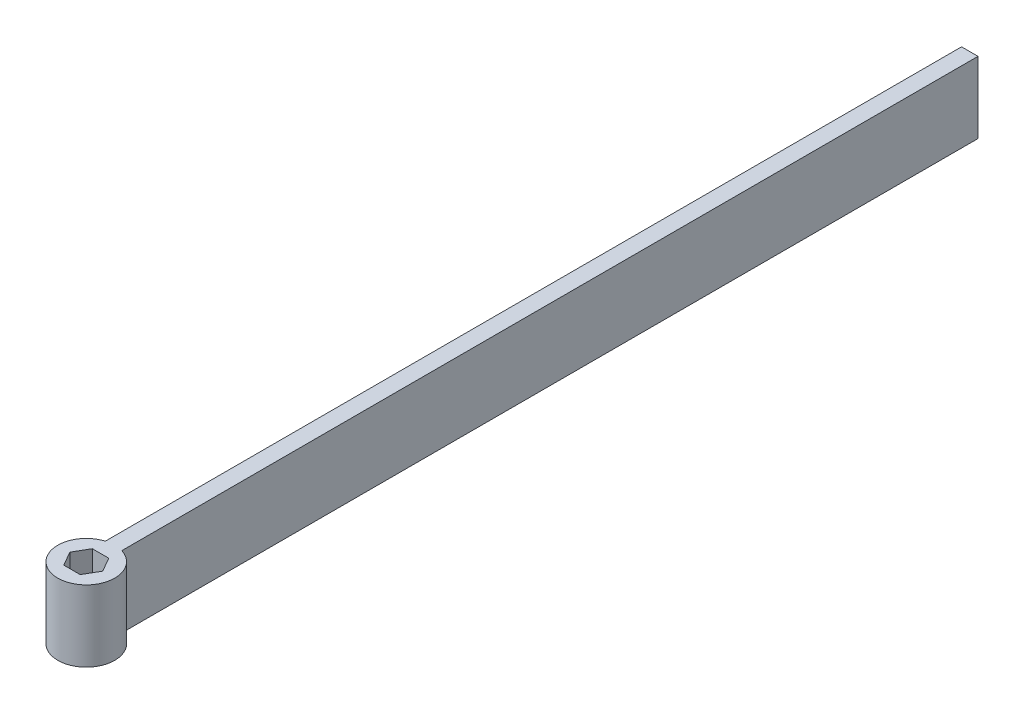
ISO-10303-21;
HEADER;
FILE_DESCRIPTION(('STEP AP214'),'2;1');
FILE_NAME('part.step','',(''),(''),'','','');
FILE_SCHEMA(('AUTOMOTIVE_DESIGN { 1 0 10303 214 1 1 1 1 }'));
ENDSEC;
DATA;
#1=APPLICATION_CONTEXT('core data for automotive mechanical design processes');
#2=APPLICATION_PROTOCOL_DEFINITION('international standard','automotive_design',2000,#1);
#3=PRODUCT_CONTEXT('',#1,'mechanical');
#4=PRODUCT('Part','Part','',(#3));
#5=PRODUCT_RELATED_PRODUCT_CATEGORY('part','',(#4));
#6=PRODUCT_DEFINITION_FORMATION('','',#4);
#7=PRODUCT_DEFINITION_CONTEXT('part definition',#1,'design');
#8=PRODUCT_DEFINITION('design','',#6,#7);
#9=PRODUCT_DEFINITION_SHAPE('','',#8);
#10=(LENGTH_UNIT() NAMED_UNIT(*) SI_UNIT(.MILLI.,.METRE.));
#11=(NAMED_UNIT(*) PLANE_ANGLE_UNIT() SI_UNIT($,.RADIAN.));
#12=(NAMED_UNIT(*) SI_UNIT($,.STERADIAN.) SOLID_ANGLE_UNIT());
#13=UNCERTAINTY_MEASURE_WITH_UNIT(LENGTH_MEASURE(1.E-05),#10,'distance_accuracy_value','');
#14=(GEOMETRIC_REPRESENTATION_CONTEXT(3) GLOBAL_UNCERTAINTY_ASSIGNED_CONTEXT((#13)) GLOBAL_UNIT_ASSIGNED_CONTEXT((#10,
#11,#12)) REPRESENTATION_CONTEXT('',''));
#15=CARTESIAN_POINT('',(0.,0.,0.));
#16=DIRECTION('',(0.,0.,1.));
#17=DIRECTION('',(1.,0.,0.));
#18=AXIS2_PLACEMENT_3D('',#15,#16,#17);
#19=CARTESIAN_POINT('',(0.,0.,-20.));
#20=DIRECTION('',(0.,0.,1.));
#21=DIRECTION('',(1.,0.,0.));
#22=AXIS2_PLACEMENT_3D('',#19,#20,#21);
#23=PLANE('',#22);
#24=DIRECTION('',(0.,-1.,0.));
#25=VECTOR('',#24,1.);
#26=CARTESIAN_POINT('',(-2.,45.,-20.));
#27=LINE('',#26,#25);
#28=CARTESIAN_POINT('',(-2.,45.,-20.));
#29=VERTEX_POINT('',#28);
#30=CARTESIAN_POINT('',(-2.,0.,-20.));
#31=VERTEX_POINT('',#30);
#32=EDGE_CURVE('E57',#29,#31,#27,.T.);
#33=ORIENTED_EDGE('',*,*,#32,.F.);
#34=DIRECTION('',(-1.,0.,0.));
#35=VECTOR('',#34,1.);
#36=CARTESIAN_POINT('',(2.,45.,-20.));
#37=LINE('',#36,#35);
#38=CARTESIAN_POINT('',(2.,45.,-20.));
#39=VERTEX_POINT('',#38);
#40=EDGE_CURVE('E179',#39,#29,#37,.T.);
#41=ORIENTED_EDGE('',*,*,#40,.F.);
#42=DIRECTION('',(0.,1.,0.));
#43=VECTOR('',#42,1.);
#44=CARTESIAN_POINT('',(2.,0.,-20.));
#45=LINE('',#44,#43);
#46=CARTESIAN_POINT('',(2.,0.,-20.));
#47=VERTEX_POINT('',#46);
#48=EDGE_CURVE('E62',#47,#39,#45,.T.);
#49=ORIENTED_EDGE('',*,*,#48,.F.);
#50=DIRECTION('',(1.,0.,0.));
#51=VECTOR('',#50,1.);
#52=CARTESIAN_POINT('',(-5.77350269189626,0.,-20.));
#53=LINE('',#52,#51);
#54=EDGE_CURVE('E166',#31,#47,#53,.T.);
#55=ORIENTED_EDGE('',*,*,#54,.F.);
#56=EDGE_LOOP('',(#33,#41,#49,#55));
#57=FACE_BOUND('',#56,.T.);
#58=ADVANCED_FACE('F40',(#57),#23,.F.);
#59=CARTESIAN_POINT('',(0.,50.,0.));
#60=DIRECTION('',(0.,1.,0.));
#61=DIRECTION('',(0.,0.,1.));
#62=AXIS2_PLACEMENT_3D('',#59,#60,#61);
#63=PLANE('',#62);
#64=DIRECTION('',(-0.5,0.,0.866025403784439));
#65=VECTOR('',#64,1.);
#66=CARTESIAN_POINT('',(-5.77350269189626,50.,-10.));
#67=LINE('',#66,#65);
#68=CARTESIAN_POINT('',(-5.77350269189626,50.,-10.));
#69=VERTEX_POINT('',#68);
#70=CARTESIAN_POINT('',(-11.5470053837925,50.,0.));
#71=VERTEX_POINT('',#70);
#72=EDGE_CURVE('E242',#69,#71,#67,.T.);
#73=ORIENTED_EDGE('',*,*,#72,.F.);
#74=DIRECTION('',(-1.,0.,0.));
#75=VECTOR('',#74,1.);
#76=CARTESIAN_POINT('',(5.77350269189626,50.,-10.));
#77=LINE('',#76,#75);
#78=CARTESIAN_POINT('',(5.77350269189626,50.,-10.));
#79=VERTEX_POINT('',#78);
#80=EDGE_CURVE('E240',#79,#69,#77,.T.);
#81=ORIENTED_EDGE('',*,*,#80,.F.);
#82=DIRECTION('',(-0.5,0.,-0.866025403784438));
#83=VECTOR('',#82,1.);
#84=CARTESIAN_POINT('',(11.5470053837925,50.,0.));
#85=LINE('',#84,#83);
#86=CARTESIAN_POINT('',(11.5470053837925,50.,0.));
#87=VERTEX_POINT('',#86);
#88=EDGE_CURVE('E237',#87,#79,#85,.T.);
#89=ORIENTED_EDGE('',*,*,#88,.F.);
#90=DIRECTION('',(0.5,0.,-0.866025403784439));
#91=VECTOR('',#90,1.);
#92=CARTESIAN_POINT('',(5.77350269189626,50.,10.));
#93=LINE('',#92,#91);
#94=CARTESIAN_POINT('',(5.77350269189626,50.,10.));
#95=VERTEX_POINT('',#94);
#96=EDGE_CURVE('E235',#95,#87,#93,.T.);
#97=ORIENTED_EDGE('',*,*,#96,.F.);
#98=DIRECTION('',(1.,0.,0.));
#99=VECTOR('',#98,1.);
#100=CARTESIAN_POINT('',(-5.77350269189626,50.,10.));
#101=LINE('',#100,#99);
#102=CARTESIAN_POINT('',(-5.77350269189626,50.,10.));
#103=VERTEX_POINT('',#102);
#104=EDGE_CURVE('E247',#103,#95,#101,.T.);
#105=ORIENTED_EDGE('',*,*,#104,.F.);
#106=DIRECTION('',(0.5,0.,0.866025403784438));
#107=VECTOR('',#106,1.);
#108=CARTESIAN_POINT('',(-11.5470053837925,50.,0.));
#109=LINE('',#108,#107);
#110=EDGE_CURVE('E244',#71,#103,#109,.T.);
#111=ORIENTED_EDGE('',*,*,#110,.F.);
#112=EDGE_LOOP('',(#73,#81,#89,#97,#105,#111));
#113=FACE_BOUND('',#112,.T.);
#114=DIRECTION('',(0.,0.,1.));
#115=VECTOR('',#114,1.);
#116=CARTESIAN_POINT('',(-5.77350269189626,50.,-20.));
#117=LINE('',#116,#115);
#118=CARTESIAN_POINT('',(-5.77350269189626,50.,-620.));
#119=VERTEX_POINT('',#118);
#120=CARTESIAN_POINT('',(-5.77350269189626,50.,-19.1485421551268));
#121=VERTEX_POINT('',#120);
#122=EDGE_CURVE('E189',#119,#121,#117,.T.);
#123=ORIENTED_EDGE('',*,*,#122,.T.);
#124=CARTESIAN_POINT('',(0.,50.,0.));
#125=DIRECTION('',(0.,1.,0.));
#126=DIRECTION('',(0.,0.,1.));
#127=AXIS2_PLACEMENT_3D('',#124,#125,#126);
#128=CIRCLE('',#127,20.);
#129=CARTESIAN_POINT('',(5.77350269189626,50.,-19.1485421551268));
#130=VERTEX_POINT('',#129);
#131=EDGE_CURVE('E11',#121,#130,#128,.T.);
#132=ORIENTED_EDGE('',*,*,#131,.T.);
#133=DIRECTION('',(0.,0.,1.));
#134=VECTOR('',#133,1.);
#135=CARTESIAN_POINT('',(5.77350269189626,50.,-20.));
#136=LINE('',#135,#134);
#137=CARTESIAN_POINT('',(5.77350269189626,50.,-620.));
#138=VERTEX_POINT('',#137);
#139=EDGE_CURVE('E223',#138,#130,#136,.T.);
#140=ORIENTED_EDGE('',*,*,#139,.F.);
#141=DIRECTION('',(1.,0.,0.));
#142=VECTOR('',#141,1.);
#143=CARTESIAN_POINT('',(-5.77350269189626,50.,-620.));
#144=LINE('',#143,#142);
#145=EDGE_CURVE('E211',#119,#138,#144,.T.);
#146=ORIENTED_EDGE('',*,*,#145,.F.);
#147=EDGE_LOOP('',(#123,#132,#140,#146));
#148=FACE_BOUND('',#147,.T.);
#149=ADVANCED_FACE('F295',(#113,#148),#63,.T.);
#150=CARTESIAN_POINT('',(0.,0.,0.));
#151=DIRECTION('',(0.,1.,0.));
#152=DIRECTION('',(0.,0.,1.));
#153=AXIS2_PLACEMENT_3D('',#150,#151,#152);
#154=PLANE('',#153);
#155=DIRECTION('',(-1.,0.,0.));
#156=VECTOR('',#155,1.);
#157=CARTESIAN_POINT('',(5.77350269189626,0.,-10.));
#158=LINE('',#157,#156);
#159=CARTESIAN_POINT('',(5.77350269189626,0.,-10.));
#160=VERTEX_POINT('',#159);
#161=CARTESIAN_POINT('',(-5.77350269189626,0.,-10.));
#162=VERTEX_POINT('',#161);
#163=EDGE_CURVE('E255',#160,#162,#158,.T.);
#164=ORIENTED_EDGE('',*,*,#163,.T.);
#165=DIRECTION('',(-0.5,0.,0.866025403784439));
#166=VECTOR('',#165,1.);
#167=CARTESIAN_POINT('',(-5.77350269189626,0.,-10.));
#168=LINE('',#167,#166);
#169=CARTESIAN_POINT('',(-11.5470053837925,0.,0.));
#170=VERTEX_POINT('',#169);
#171=EDGE_CURVE('E258',#162,#170,#168,.T.);
#172=ORIENTED_EDGE('',*,*,#171,.T.);
#173=DIRECTION('',(0.5,0.,0.866025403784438));
#174=VECTOR('',#173,1.);
#175=CARTESIAN_POINT('',(-11.5470053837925,0.,0.));
#176=LINE('',#175,#174);
#177=CARTESIAN_POINT('',(-5.77350269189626,0.,10.));
#178=VERTEX_POINT('',#177);
#179=EDGE_CURVE('E261',#170,#178,#176,.T.);
#180=ORIENTED_EDGE('',*,*,#179,.T.);
#181=DIRECTION('',(1.,0.,0.));
#182=VECTOR('',#181,1.);
#183=CARTESIAN_POINT('',(-5.77350269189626,0.,10.));
#184=LINE('',#183,#182);
#185=CARTESIAN_POINT('',(5.77350269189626,0.,10.));
#186=VERTEX_POINT('',#185);
#187=EDGE_CURVE('E238',#178,#186,#184,.T.);
#188=ORIENTED_EDGE('',*,*,#187,.T.);
#189=DIRECTION('',(0.5,0.,-0.866025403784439));
#190=VECTOR('',#189,1.);
#191=CARTESIAN_POINT('',(5.77350269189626,0.,10.));
#192=LINE('',#191,#190);
#193=CARTESIAN_POINT('',(11.5470053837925,0.,0.));
#194=VERTEX_POINT('',#193);
#195=EDGE_CURVE('E234',#186,#194,#192,.T.);
#196=ORIENTED_EDGE('',*,*,#195,.T.);
#197=DIRECTION('',(-0.5,0.,-0.866025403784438));
#198=VECTOR('',#197,1.);
#199=CARTESIAN_POINT('',(11.5470053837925,0.,0.));
#200=LINE('',#199,#198);
#201=EDGE_CURVE('E252',#194,#160,#200,.T.);
#202=ORIENTED_EDGE('',*,*,#201,.T.);
#203=EDGE_LOOP('',(#164,#172,#180,#188,#196,#202));
#204=FACE_BOUND('',#203,.T.);
#205=CARTESIAN_POINT('',(0.,0.,0.));
#206=DIRECTION('',(0.,1.,0.));
#207=DIRECTION('',(0.,0.,1.));
#208=AXIS2_PLACEMENT_3D('',#205,#206,#207);
#209=CIRCLE('',#208,20.);
#210=CARTESIAN_POINT('',(-5.77350269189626,0.,-19.1485421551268));
#211=VERTEX_POINT('',#210);
#212=CARTESIAN_POINT('',(5.77350269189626,0.,-19.1485421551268));
#213=VERTEX_POINT('',#212);
#214=EDGE_CURVE('E49',#211,#213,#209,.T.);
#215=ORIENTED_EDGE('',*,*,#214,.F.);
#216=DIRECTION('',(0.,0.,1.));
#217=VECTOR('',#216,1.);
#218=CARTESIAN_POINT('',(-5.77350269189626,0.,-20.));
#219=LINE('',#218,#217);
#220=CARTESIAN_POINT('',(-5.77350269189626,0.,-620.));
#221=VERTEX_POINT('',#220);
#222=EDGE_CURVE('E168',#221,#211,#219,.T.);
#223=ORIENTED_EDGE('',*,*,#222,.F.);
#224=DIRECTION('',(-1.,0.,0.));
#225=VECTOR('',#224,1.);
#226=CARTESIAN_POINT('',(-2.,0.,-620.));
#227=LINE('',#226,#225);
#228=CARTESIAN_POINT('',(-2.,0.,-620.));
#229=VERTEX_POINT('',#228);
#230=EDGE_CURVE('E202',#229,#221,#227,.T.);
#231=ORIENTED_EDGE('',*,*,#230,.F.);
#232=DIRECTION('',(0.,0.,1.));
#233=VECTOR('',#232,1.);
#234=CARTESIAN_POINT('',(-2.,0.,-620.));
#235=LINE('',#234,#233);
#236=EDGE_CURVE('E180',#229,#31,#235,.T.);
#237=ORIENTED_EDGE('',*,*,#236,.T.);
#238=ORIENTED_EDGE('',*,*,#54,.T.);
#239=DIRECTION('',(0.,0.,1.));
#240=VECTOR('',#239,1.);
#241=CARTESIAN_POINT('',(2.,0.,-620.));
#242=LINE('',#241,#240);
#243=CARTESIAN_POINT('',(2.,0.,-620.));
#244=VERTEX_POINT('',#243);
#245=EDGE_CURVE('E146',#244,#47,#242,.T.);
#246=ORIENTED_EDGE('',*,*,#245,.F.);
#247=DIRECTION('',(-1.,0.,0.));
#248=VECTOR('',#247,1.);
#249=CARTESIAN_POINT('',(5.77350269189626,0.,-620.));
#250=LINE('',#249,#248);
#251=CARTESIAN_POINT('',(5.77350269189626,0.,-620.));
#252=VERTEX_POINT('',#251);
#253=EDGE_CURVE('E152',#252,#244,#250,.T.);
#254=ORIENTED_EDGE('',*,*,#253,.F.);
#255=DIRECTION('',(0.,0.,1.));
#256=VECTOR('',#255,1.);
#257=CARTESIAN_POINT('',(5.77350269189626,0.,-20.));
#258=LINE('',#257,#256);
#259=EDGE_CURVE('E227',#252,#213,#258,.T.);
#260=ORIENTED_EDGE('',*,*,#259,.T.);
#261=EDGE_LOOP('',(#215,#223,#231,#237,#238,#246,#254,#260));
#262=FACE_BOUND('',#261,.T.);
#263=ADVANCED_FACE('F164',(#204,#262),#154,.F.);
#264=CARTESIAN_POINT('',(0.,50.,0.));
#265=DIRECTION('',(0.,-1.,0.));
#266=DIRECTION('',(0.,0.,-1.));
#267=AXIS2_PLACEMENT_3D('',#264,#265,#266);
#268=CYLINDRICAL_SURFACE('',#267,20.);
#269=ORIENTED_EDGE('',*,*,#131,.F.);
#270=DIRECTION('',(0.,-1.,0.));
#271=VECTOR('',#270,1.);
#272=CARTESIAN_POINT('',(-5.77350269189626,50.,-19.1485421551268));
#273=LINE('',#272,#271);
#274=EDGE_CURVE('E221',#121,#211,#273,.T.);
#275=ORIENTED_EDGE('',*,*,#274,.T.);
#276=ORIENTED_EDGE('',*,*,#214,.T.);
#277=DIRECTION('',(0.,-1.,0.));
#278=VECTOR('',#277,1.);
#279=CARTESIAN_POINT('',(5.77350269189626,50.,-19.1485421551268));
#280=LINE('',#279,#278);
#281=EDGE_CURVE('E224',#213,#130,#280,.F.);
#282=ORIENTED_EDGE('',*,*,#281,.T.);
#283=EDGE_LOOP('',(#269,#275,#276,#282));
#284=FACE_BOUND('',#283,.T.);
#285=ADVANCED_FACE('F42',(#284),#268,.T.);
#286=CARTESIAN_POINT('',(5.77350269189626,50.,10.));
#287=DIRECTION('',(-0.866025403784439,0.,-0.5));
#288=DIRECTION('',(-0.5,0.,0.866025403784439));
#289=AXIS2_PLACEMENT_3D('',#286,#287,#288);
#290=PLANE('',#289);
#291=ORIENTED_EDGE('',*,*,#195,.F.);
#292=DIRECTION('',(0.,-1.,0.));
#293=VECTOR('',#292,1.);
#294=CARTESIAN_POINT('',(5.77350269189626,50.,10.));
#295=LINE('',#294,#293);
#296=EDGE_CURVE('E249',#95,#186,#295,.T.);
#297=ORIENTED_EDGE('',*,*,#296,.F.);
#298=ORIENTED_EDGE('',*,*,#96,.T.);
#299=DIRECTION('',(0.,-1.,0.));
#300=VECTOR('',#299,1.);
#301=CARTESIAN_POINT('',(11.5470053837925,50.,0.));
#302=LINE('',#301,#300);
#303=EDGE_CURVE('E276',#87,#194,#302,.T.);
#304=ORIENTED_EDGE('',*,*,#303,.T.);
#305=EDGE_LOOP('',(#291,#297,#298,#304));
#306=FACE_BOUND('',#305,.T.);
#307=ADVANCED_FACE('F362',(#306),#290,.T.);
#308=CARTESIAN_POINT('',(11.5470053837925,50.,0.));
#309=DIRECTION('',(-0.866025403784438,0.,0.5));
#310=DIRECTION('',(0.5,0.,0.866025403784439));
#311=AXIS2_PLACEMENT_3D('',#308,#309,#310);
#312=PLANE('',#311);
#313=ORIENTED_EDGE('',*,*,#201,.F.);
#314=ORIENTED_EDGE('',*,*,#303,.F.);
#315=ORIENTED_EDGE('',*,*,#88,.T.);
#316=DIRECTION('',(0.,-1.,0.));
#317=VECTOR('',#316,1.);
#318=CARTESIAN_POINT('',(5.77350269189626,50.,-10.));
#319=LINE('',#318,#317);
#320=EDGE_CURVE('E274',#79,#160,#319,.T.);
#321=ORIENTED_EDGE('',*,*,#320,.T.);
#322=EDGE_LOOP('',(#313,#314,#315,#321));
#323=FACE_BOUND('',#322,.T.);
#324=ADVANCED_FACE('F399',(#323),#312,.T.);
#325=CARTESIAN_POINT('',(5.77350269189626,50.,-10.));
#326=DIRECTION('',(0.,0.,1.));
#327=DIRECTION('',(1.,0.,0.));
#328=AXIS2_PLACEMENT_3D('',#325,#326,#327);
#329=PLANE('',#328);
#330=ORIENTED_EDGE('',*,*,#163,.F.);
#331=ORIENTED_EDGE('',*,*,#320,.F.);
#332=ORIENTED_EDGE('',*,*,#80,.T.);
#333=DIRECTION('',(0.,-1.,0.));
#334=VECTOR('',#333,1.);
#335=CARTESIAN_POINT('',(-5.77350269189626,50.,-10.));
#336=LINE('',#335,#334);
#337=EDGE_CURVE('E272',#69,#162,#336,.T.);
#338=ORIENTED_EDGE('',*,*,#337,.T.);
#339=EDGE_LOOP('',(#330,#331,#332,#338));
#340=FACE_BOUND('',#339,.T.);
#341=ADVANCED_FACE('F390',(#340),#329,.T.);
#342=CARTESIAN_POINT('',(-5.77350269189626,50.,-10.));
#343=DIRECTION('',(0.866025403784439,0.,0.5));
#344=DIRECTION('',(0.5,0.,-0.866025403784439));
#345=AXIS2_PLACEMENT_3D('',#342,#343,#344);
#346=PLANE('',#345);
#347=ORIENTED_EDGE('',*,*,#171,.F.);
#348=ORIENTED_EDGE('',*,*,#337,.F.);
#349=ORIENTED_EDGE('',*,*,#72,.T.);
#350=DIRECTION('',(0.,-1.,0.));
#351=VECTOR('',#350,1.);
#352=CARTESIAN_POINT('',(-11.5470053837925,50.,0.));
#353=LINE('',#352,#351);
#354=EDGE_CURVE('E270',#71,#170,#353,.T.);
#355=ORIENTED_EDGE('',*,*,#354,.T.);
#356=EDGE_LOOP('',(#347,#348,#349,#355));
#357=FACE_BOUND('',#356,.T.);
#358=ADVANCED_FACE('F379',(#357),#346,.T.);
#359=CARTESIAN_POINT('',(-11.5470053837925,50.,0.));
#360=DIRECTION('',(0.866025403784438,0.,-0.5));
#361=DIRECTION('',(-0.5,0.,-0.866025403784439));
#362=AXIS2_PLACEMENT_3D('',#359,#360,#361);
#363=PLANE('',#362);
#364=ORIENTED_EDGE('',*,*,#179,.F.);
#365=ORIENTED_EDGE('',*,*,#354,.F.);
#366=ORIENTED_EDGE('',*,*,#110,.T.);
#367=DIRECTION('',(0.,-1.,0.));
#368=VECTOR('',#367,1.);
#369=CARTESIAN_POINT('',(-5.77350269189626,50.,10.));
#370=LINE('',#369,#368);
#371=EDGE_CURVE('E268',#103,#178,#370,.T.);
#372=ORIENTED_EDGE('',*,*,#371,.T.);
#373=EDGE_LOOP('',(#364,#365,#366,#372));
#374=FACE_BOUND('',#373,.T.);
#375=ADVANCED_FACE('F290',(#374),#363,.T.);
#376=CARTESIAN_POINT('',(-5.77350269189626,50.,10.));
#377=DIRECTION('',(0.,0.,-1.));
#378=DIRECTION('',(-1.,0.,0.));
#379=AXIS2_PLACEMENT_3D('',#376,#377,#378);
#380=PLANE('',#379);
#381=ORIENTED_EDGE('',*,*,#187,.F.);
#382=ORIENTED_EDGE('',*,*,#371,.F.);
#383=ORIENTED_EDGE('',*,*,#104,.T.);
#384=ORIENTED_EDGE('',*,*,#296,.T.);
#385=EDGE_LOOP('',(#381,#382,#383,#384));
#386=FACE_BOUND('',#385,.T.);
#387=ADVANCED_FACE('F283',(#386),#380,.T.);
#388=CARTESIAN_POINT('',(5.77350269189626,50.,-20.));
#389=DIRECTION('',(1.,0.,0.));
#390=DIRECTION('',(0.,0.,-1.));
#391=AXIS2_PLACEMENT_3D('',#388,#389,#390);
#392=PLANE('',#391);
#393=ORIENTED_EDGE('',*,*,#281,.F.);
#394=ORIENTED_EDGE('',*,*,#259,.F.);
#395=DIRECTION('',(0.,-1.,0.));
#396=VECTOR('',#395,1.);
#397=CARTESIAN_POINT('',(5.77350269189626,50.,-620.));
#398=LINE('',#397,#396);
#399=EDGE_CURVE('E159',#138,#252,#398,.T.);
#400=ORIENTED_EDGE('',*,*,#399,.F.);
#401=ORIENTED_EDGE('',*,*,#139,.T.);
#402=EDGE_LOOP('',(#393,#394,#400,#401));
#403=FACE_BOUND('',#402,.T.);
#404=ADVANCED_FACE('F281',(#403),#392,.T.);
#405=CARTESIAN_POINT('',(-5.77350269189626,50.,-20.));
#406=DIRECTION('',(-1.,0.,0.));
#407=DIRECTION('',(0.,0.,1.));
#408=AXIS2_PLACEMENT_3D('',#405,#406,#407);
#409=PLANE('',#408);
#410=ORIENTED_EDGE('',*,*,#274,.F.);
#411=ORIENTED_EDGE('',*,*,#122,.F.);
#412=DIRECTION('',(0.,1.,0.));
#413=VECTOR('',#412,1.);
#414=CARTESIAN_POINT('',(-5.77350269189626,0.,-620.));
#415=LINE('',#414,#413);
#416=EDGE_CURVE('E205',#221,#119,#415,.T.);
#417=ORIENTED_EDGE('',*,*,#416,.F.);
#418=ORIENTED_EDGE('',*,*,#222,.T.);
#419=EDGE_LOOP('',(#410,#411,#417,#418));
#420=FACE_BOUND('',#419,.T.);
#421=ADVANCED_FACE('F218',(#420),#409,.T.);
#422=CARTESIAN_POINT('',(2.,0.,-620.));
#423=DIRECTION('',(1.,0.,0.));
#424=DIRECTION('',(0.,0.,-1.));
#425=AXIS2_PLACEMENT_3D('',#422,#423,#424);
#426=PLANE('',#425);
#427=ORIENTED_EDGE('',*,*,#48,.T.);
#428=DIRECTION('',(0.,0.,1.));
#429=VECTOR('',#428,1.);
#430=CARTESIAN_POINT('',(2.,45.,-620.));
#431=LINE('',#430,#429);
#432=CARTESIAN_POINT('',(2.,45.,-620.));
#433=VERTEX_POINT('',#432);
#434=EDGE_CURVE('E148',#433,#39,#431,.T.);
#435=ORIENTED_EDGE('',*,*,#434,.F.);
#436=DIRECTION('',(0.,1.,0.));
#437=VECTOR('',#436,1.);
#438=CARTESIAN_POINT('',(2.,0.,-620.));
#439=LINE('',#438,#437);
#440=EDGE_CURVE('E142',#244,#433,#439,.T.);
#441=ORIENTED_EDGE('',*,*,#440,.F.);
#442=ORIENTED_EDGE('',*,*,#245,.T.);
#443=EDGE_LOOP('',(#427,#435,#441,#442));
#444=FACE_BOUND('',#443,.T.);
#445=ADVANCED_FACE('F144',(#444),#426,.F.);
#446=CARTESIAN_POINT('',(2.,45.,-620.));
#447=DIRECTION('',(0.,1.,0.));
#448=DIRECTION('',(0.,0.,1.));
#449=AXIS2_PLACEMENT_3D('',#446,#447,#448);
#450=PLANE('',#449);
#451=ORIENTED_EDGE('',*,*,#40,.T.);
#452=DIRECTION('',(0.,0.,1.));
#453=VECTOR('',#452,1.);
#454=CARTESIAN_POINT('',(-2.,45.,-620.));
#455=LINE('',#454,#453);
#456=CARTESIAN_POINT('',(-2.,45.,-620.));
#457=VERTEX_POINT('',#456);
#458=EDGE_CURVE('E170',#457,#29,#455,.T.);
#459=ORIENTED_EDGE('',*,*,#458,.F.);
#460=DIRECTION('',(-1.,0.,0.));
#461=VECTOR('',#460,1.);
#462=CARTESIAN_POINT('',(2.,45.,-620.));
#463=LINE('',#462,#461);
#464=EDGE_CURVE('E151',#433,#457,#463,.T.);
#465=ORIENTED_EDGE('',*,*,#464,.F.);
#466=ORIENTED_EDGE('',*,*,#434,.T.);
#467=EDGE_LOOP('',(#451,#459,#465,#466));
#468=FACE_BOUND('',#467,.T.);
#469=ADVANCED_FACE('F194',(#468),#450,.F.);
#470=CARTESIAN_POINT('',(-2.,45.,-620.));
#471=DIRECTION('',(-1.,0.,0.));
#472=DIRECTION('',(0.,0.,1.));
#473=AXIS2_PLACEMENT_3D('',#470,#471,#472);
#474=PLANE('',#473);
#475=ORIENTED_EDGE('',*,*,#32,.T.);
#476=ORIENTED_EDGE('',*,*,#236,.F.);
#477=DIRECTION('',(0.,-1.,0.));
#478=VECTOR('',#477,1.);
#479=CARTESIAN_POINT('',(-2.,45.,-620.));
#480=LINE('',#479,#478);
#481=EDGE_CURVE('E199',#457,#229,#480,.T.);
#482=ORIENTED_EDGE('',*,*,#481,.F.);
#483=ORIENTED_EDGE('',*,*,#458,.T.);
#484=EDGE_LOOP('',(#475,#476,#482,#483));
#485=FACE_BOUND('',#484,.T.);
#486=ADVANCED_FACE('F197',(#485),#474,.F.);
#487=CARTESIAN_POINT('',(0.,0.,-620.));
#488=DIRECTION('',(0.,0.,-1.));
#489=DIRECTION('',(-1.,0.,0.));
#490=AXIS2_PLACEMENT_3D('',#487,#488,#489);
#491=PLANE('',#490);
#492=ORIENTED_EDGE('',*,*,#253,.T.);
#493=ORIENTED_EDGE('',*,*,#440,.T.);
#494=ORIENTED_EDGE('',*,*,#464,.T.);
#495=ORIENTED_EDGE('',*,*,#481,.T.);
#496=ORIENTED_EDGE('',*,*,#230,.T.);
#497=ORIENTED_EDGE('',*,*,#416,.T.);
#498=ORIENTED_EDGE('',*,*,#145,.T.);
#499=ORIENTED_EDGE('',*,*,#399,.T.);
#500=EDGE_LOOP('',(#492,#493,#494,#495,#496,#497,#498,#499));
#501=FACE_BOUND('',#500,.T.);
#502=ADVANCED_FACE('F156',(#501),#491,.T.);
#503=CLOSED_SHELL('',(#58,#149,#263,#285,#307,#324,#341,#358,#375,#387,#404,#421,#445,#469,#486,#502));
#504=MANIFOLD_SOLID_BREP('B2',#503);
#505=ADVANCED_BREP_SHAPE_REPRESENTATION('',(#18,#504),#14);
#506=SHAPE_DEFINITION_REPRESENTATION(#9,#505);
ENDSEC;
END-ISO-10303-21;
